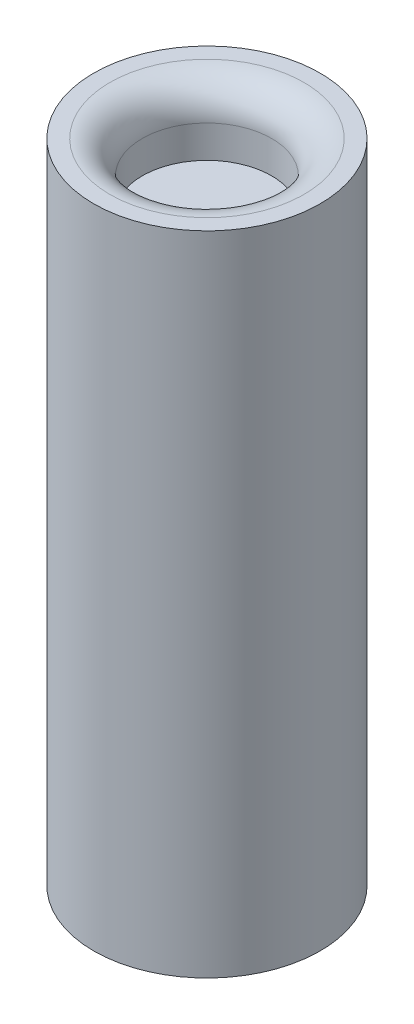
ISO-10303-21;
HEADER;
FILE_DESCRIPTION(('STEP AP214'),'2;1');
FILE_NAME('part.step','',(''),(''),'','','');
FILE_SCHEMA(('AUTOMOTIVE_DESIGN { 1 0 10303 214 1 1 1 1 }'));
ENDSEC;
DATA;
#1=APPLICATION_CONTEXT('core data for automotive mechanical design processes');
#2=APPLICATION_PROTOCOL_DEFINITION('international standard','automotive_design',2000,#1);
#3=PRODUCT_CONTEXT('',#1,'mechanical');
#4=PRODUCT('Part','Part','',(#3));
#5=PRODUCT_RELATED_PRODUCT_CATEGORY('part','',(#4));
#6=PRODUCT_DEFINITION_FORMATION('','',#4);
#7=PRODUCT_DEFINITION_CONTEXT('part definition',#1,'design');
#8=PRODUCT_DEFINITION('design','',#6,#7);
#9=PRODUCT_DEFINITION_SHAPE('','',#8);
#10=(LENGTH_UNIT() NAMED_UNIT(*) SI_UNIT(.MILLI.,.METRE.));
#11=(NAMED_UNIT(*) PLANE_ANGLE_UNIT() SI_UNIT($,.RADIAN.));
#12=(NAMED_UNIT(*) SI_UNIT($,.STERADIAN.) SOLID_ANGLE_UNIT());
#13=UNCERTAINTY_MEASURE_WITH_UNIT(LENGTH_MEASURE(1.E-05),#10,'distance_accuracy_value','');
#14=(GEOMETRIC_REPRESENTATION_CONTEXT(3) GLOBAL_UNCERTAINTY_ASSIGNED_CONTEXT((#13)) GLOBAL_UNIT_ASSIGNED_CONTEXT((#10,
#11,#12)) REPRESENTATION_CONTEXT('',''));
#15=CARTESIAN_POINT('',(0.,0.,0.));
#16=DIRECTION('',(0.,0.,1.));
#17=DIRECTION('',(1.,0.,0.));
#18=AXIS2_PLACEMENT_3D('',#15,#16,#17);
#19=CARTESIAN_POINT('',(0.,100.,0.));
#20=DIRECTION('',(0.,-1.,0.));
#21=DIRECTION('',(0.,0.,-1.));
#22=AXIS2_PLACEMENT_3D('',#19,#20,#21);
#23=CYLINDRICAL_SURFACE('',#22,17.5);
#24=CARTESIAN_POINT('',(0.,100.,0.));
#25=DIRECTION('',(0.,1.,0.));
#26=DIRECTION('',(0.,0.,1.));
#27=AXIS2_PLACEMENT_3D('',#24,#25,#26);
#28=CIRCLE('',#27,17.5);
#29=CARTESIAN_POINT('',(0.,100.,17.5));
#30=VERTEX_POINT('',#29);
#31=EDGE_CURVE('E55',#30,#30,#28,.T.);
#32=ORIENTED_EDGE('',*,*,#31,.F.);
#33=EDGE_LOOP('',(#32));
#34=FACE_BOUND('',#33,.T.);
#35=CARTESIAN_POINT('',(0.,0.,0.));
#36=DIRECTION('',(0.,1.,0.));
#37=DIRECTION('',(0.,0.,1.));
#38=AXIS2_PLACEMENT_3D('',#35,#36,#37);
#39=CIRCLE('',#38,17.5);
#40=CARTESIAN_POINT('',(0.,0.,17.5));
#41=VERTEX_POINT('',#40);
#42=EDGE_CURVE('E60',#41,#41,#39,.T.);
#43=ORIENTED_EDGE('',*,*,#42,.T.);
#44=EDGE_LOOP('',(#43));
#45=FACE_BOUND('',#44,.T.);
#46=ADVANCED_FACE('F42',(#34,#45),#23,.T.);
#47=CARTESIAN_POINT('',(0.,100.,0.));
#48=DIRECTION('',(0.,1.,0.));
#49=DIRECTION('',(0.,0.,1.));
#50=AXIS2_PLACEMENT_3D('',#47,#48,#49);
#51=PLANE('',#50);
#52=CARTESIAN_POINT('',(0.,100.,0.));
#53=DIRECTION('',(0.,1.,0.));
#54=DIRECTION('',(0.,0.,1.));
#55=AXIS2_PLACEMENT_3D('',#52,#53,#54);
#56=CIRCLE('',#55,15.);
#57=CARTESIAN_POINT('',(0.,100.,15.));
#58=VERTEX_POINT('',#57);
#59=EDGE_CURVE('E10',#58,#58,#56,.F.);
#60=ORIENTED_EDGE('',*,*,#59,.T.);
#61=EDGE_LOOP('',(#60));
#62=FACE_BOUND('',#61,.T.);
#63=ORIENTED_EDGE('',*,*,#31,.T.);
#64=EDGE_LOOP('',(#63));
#65=FACE_BOUND('',#64,.T.);
#66=ADVANCED_FACE('F82',(#62,#65),#51,.T.);
#67=CARTESIAN_POINT('',(0.,0.,0.));
#68=DIRECTION('',(0.,1.,0.));
#69=DIRECTION('',(0.,0.,1.));
#70=AXIS2_PLACEMENT_3D('',#67,#68,#69);
#71=PLANE('',#70);
#72=ORIENTED_EDGE('',*,*,#42,.F.);
#73=EDGE_LOOP('',(#72));
#74=FACE_BOUND('',#73,.T.);
#75=ADVANCED_FACE('F75',(#74),#71,.F.);
#76=CARTESIAN_POINT('',(0.,90.,0.));
#77=DIRECTION('',(0.,1.,0.));
#78=DIRECTION('',(0.,0.,1.));
#79=AXIS2_PLACEMENT_3D('',#76,#77,#78);
#80=CYLINDRICAL_SURFACE('',#79,10.);
#81=CARTESIAN_POINT('',(0.,95.,0.));
#82=DIRECTION('',(0.,1.,0.));
#83=DIRECTION('',(0.,0.,1.));
#84=AXIS2_PLACEMENT_3D('',#81,#82,#83);
#85=CIRCLE('',#84,10.);
#86=CARTESIAN_POINT('',(0.,95.,10.));
#87=VERTEX_POINT('',#86);
#88=EDGE_CURVE('E50',#87,#87,#85,.T.);
#89=ORIENTED_EDGE('',*,*,#88,.T.);
#90=EDGE_LOOP('',(#89));
#91=FACE_BOUND('',#90,.T.);
#92=CARTESIAN_POINT('',(0.,90.,0.));
#93=DIRECTION('',(0.,1.,0.));
#94=DIRECTION('',(0.,0.,1.));
#95=AXIS2_PLACEMENT_3D('',#92,#93,#94);
#96=CIRCLE('',#95,10.);
#97=CARTESIAN_POINT('',(0.,90.,10.));
#98=VERTEX_POINT('',#97);
#99=EDGE_CURVE('E65',#98,#98,#96,.T.);
#100=ORIENTED_EDGE('',*,*,#99,.F.);
#101=EDGE_LOOP('',(#100));
#102=FACE_BOUND('',#101,.T.);
#103=ADVANCED_FACE('F73',(#91,#102),#80,.F.);
#104=CARTESIAN_POINT('',(0.,90.,0.));
#105=DIRECTION('',(0.,1.,0.));
#106=DIRECTION('',(0.,0.,1.));
#107=AXIS2_PLACEMENT_3D('',#104,#105,#106);
#108=PLANE('',#107);
#109=ORIENTED_EDGE('',*,*,#99,.T.);
#110=EDGE_LOOP('',(#109));
#111=FACE_BOUND('',#110,.T.);
#112=ADVANCED_FACE('F71',(#111),#108,.T.);
#113=CARTESIAN_POINT('',(0.,95.,0.));
#114=DIRECTION('',(0.,1.,0.));
#115=DIRECTION('',(0.,0.,1.));
#116=AXIS2_PLACEMENT_3D('',#113,#114,#115);
#117=TOROIDAL_SURFACE('',#116,15.,5.);
#118=ORIENTED_EDGE('',*,*,#59,.F.);
#119=EDGE_LOOP('',(#118));
#120=FACE_BOUND('',#119,.T.);
#121=ORIENTED_EDGE('',*,*,#88,.F.);
#122=EDGE_LOOP('',(#121));
#123=FACE_BOUND('',#122,.T.);
#124=ADVANCED_FACE('F44',(#120,#123),#117,.T.);
#125=CLOSED_SHELL('',(#46,#66,#75,#103,#112,#124));
#126=MANIFOLD_SOLID_BREP('B2',#125);
#127=ADVANCED_BREP_SHAPE_REPRESENTATION('',(#18,#126),#14);
#128=SHAPE_DEFINITION_REPRESENTATION(#9,#127);
ENDSEC;
END-ISO-10303-21;
